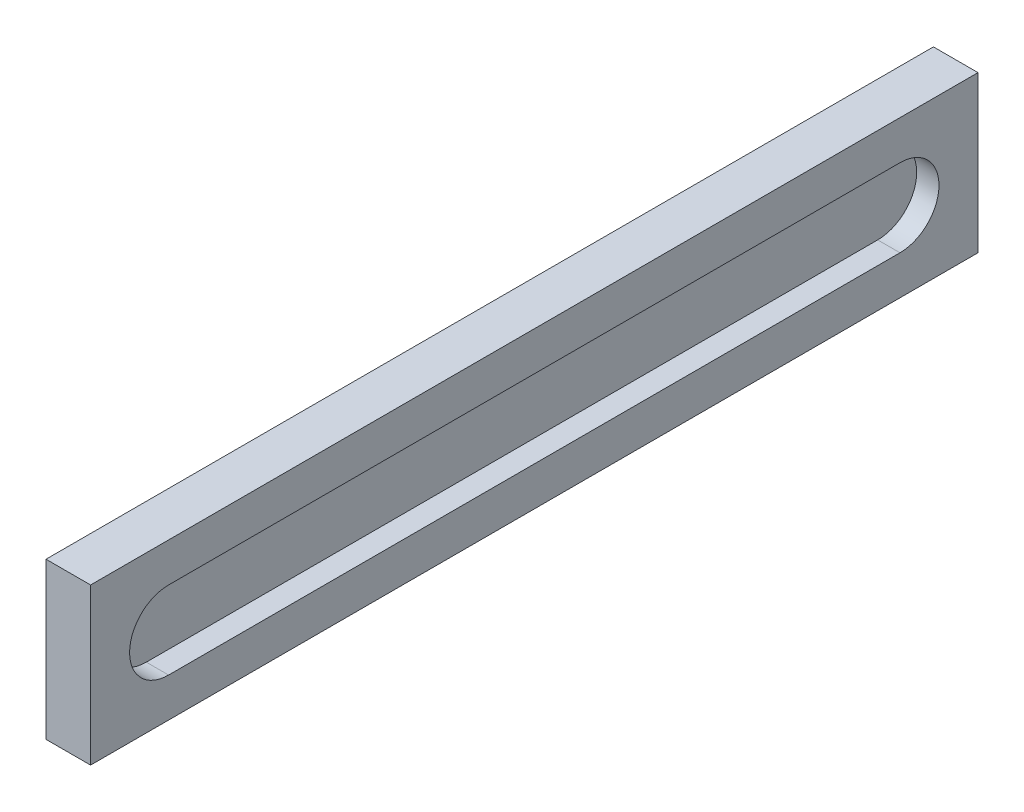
ISO-10303-21;
HEADER;
FILE_DESCRIPTION(('STEP AP214'),'2;1');
FILE_NAME('part.step','',(''),(''),'','','');
FILE_SCHEMA(('AUTOMOTIVE_DESIGN { 1 0 10303 214 1 1 1 1 }'));
ENDSEC;
DATA;
#1=APPLICATION_CONTEXT('core data for automotive mechanical design processes');
#2=APPLICATION_PROTOCOL_DEFINITION('international standard','automotive_design',2000,#1);
#3=PRODUCT_CONTEXT('',#1,'mechanical');
#4=PRODUCT('Part','Part','',(#3));
#5=PRODUCT_RELATED_PRODUCT_CATEGORY('part','',(#4));
#6=PRODUCT_DEFINITION_FORMATION('','',#4);
#7=PRODUCT_DEFINITION_CONTEXT('part definition',#1,'design');
#8=PRODUCT_DEFINITION('design','',#6,#7);
#9=PRODUCT_DEFINITION_SHAPE('','',#8);
#10=(LENGTH_UNIT() NAMED_UNIT(*) SI_UNIT(.MILLI.,.METRE.));
#11=(NAMED_UNIT(*) PLANE_ANGLE_UNIT() SI_UNIT($,.RADIAN.));
#12=(NAMED_UNIT(*) SI_UNIT($,.STERADIAN.) SOLID_ANGLE_UNIT());
#13=UNCERTAINTY_MEASURE_WITH_UNIT(LENGTH_MEASURE(1.E-05),#10,'distance_accuracy_value','');
#14=(GEOMETRIC_REPRESENTATION_CONTEXT(3) GLOBAL_UNCERTAINTY_ASSIGNED_CONTEXT((#13)) GLOBAL_UNIT_ASSIGNED_CONTEXT((#10,
#11,#12)) REPRESENTATION_CONTEXT('',''));
#15=CARTESIAN_POINT('',(0.,0.,0.));
#16=DIRECTION('',(0.,0.,1.));
#17=DIRECTION('',(1.,0.,0.));
#18=AXIS2_PLACEMENT_3D('',#15,#16,#17);
#19=CARTESIAN_POINT('',(20.,0.,0.));
#20=DIRECTION('',(0.,0.,-1.));
#21=DIRECTION('',(-1.,0.,0.));
#22=AXIS2_PLACEMENT_3D('',#19,#20,#21);
#23=PLANE('',#22);
#24=DIRECTION('',(0.,-1.,0.));
#25=VECTOR('',#24,1.);
#26=CARTESIAN_POINT('',(0.,0.,0.));
#27=LINE('',#26,#25);
#28=CARTESIAN_POINT('',(0.,70.,0.));
#29=VERTEX_POINT('',#28);
#30=CARTESIAN_POINT('',(0.,0.,0.));
#31=VERTEX_POINT('',#30);
#32=EDGE_CURVE('E158',#29,#31,#27,.T.);
#33=ORIENTED_EDGE('',*,*,#32,.T.);
#34=DIRECTION('',(-1.,0.,0.));
#35=VECTOR('',#34,1.);
#36=CARTESIAN_POINT('',(20.,0.,0.));
#37=LINE('',#36,#35);
#38=CARTESIAN_POINT('',(20.,0.,0.));
#39=VERTEX_POINT('',#38);
#40=EDGE_CURVE('E11',#39,#31,#37,.T.);
#41=ORIENTED_EDGE('',*,*,#40,.F.);
#42=DIRECTION('',(0.,-1.,0.));
#43=VECTOR('',#42,1.);
#44=CARTESIAN_POINT('',(20.,0.,0.));
#45=LINE('',#44,#43);
#46=CARTESIAN_POINT('',(20.,70.,0.));
#47=VERTEX_POINT('',#46);
#48=EDGE_CURVE('E164',#47,#39,#45,.T.);
#49=ORIENTED_EDGE('',*,*,#48,.F.);
#50=DIRECTION('',(-1.,0.,0.));
#51=VECTOR('',#50,1.);
#52=CARTESIAN_POINT('',(20.,70.,0.));
#53=LINE('',#52,#51);
#54=EDGE_CURVE('E174',#47,#29,#53,.T.);
#55=ORIENTED_EDGE('',*,*,#54,.T.);
#56=EDGE_LOOP('',(#33,#41,#49,#55));
#57=FACE_BOUND('',#56,.T.);
#58=ADVANCED_FACE('F39',(#57),#23,.F.);
#59=CARTESIAN_POINT('',(20.,0.,0.));
#60=DIRECTION('',(0.,1.,0.));
#61=DIRECTION('',(0.,0.,1.));
#62=AXIS2_PLACEMENT_3D('',#59,#60,#61);
#63=PLANE('',#62);
#64=DIRECTION('',(0.,0.,-1.));
#65=VECTOR('',#64,1.);
#66=CARTESIAN_POINT('',(0.,0.,0.));
#67=LINE('',#66,#65);
#68=CARTESIAN_POINT('',(0.,0.,-398.100558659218));
#69=VERTEX_POINT('',#68);
#70=EDGE_CURVE('E178',#31,#69,#67,.T.);
#71=ORIENTED_EDGE('',*,*,#70,.T.);
#72=DIRECTION('',(-1.,0.,0.));
#73=VECTOR('',#72,1.);
#74=CARTESIAN_POINT('',(20.,0.,-398.100558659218));
#75=LINE('',#74,#73);
#76=CARTESIAN_POINT('',(20.,0.,-398.100558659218));
#77=VERTEX_POINT('',#76);
#78=EDGE_CURVE('E47',#77,#69,#75,.T.);
#79=ORIENTED_EDGE('',*,*,#78,.F.);
#80=DIRECTION('',(0.,0.,-1.));
#81=VECTOR('',#80,1.);
#82=CARTESIAN_POINT('',(20.,0.,0.));
#83=LINE('',#82,#81);
#84=EDGE_CURVE('E91',#39,#77,#83,.T.);
#85=ORIENTED_EDGE('',*,*,#84,.F.);
#86=ORIENTED_EDGE('',*,*,#40,.T.);
#87=EDGE_LOOP('',(#71,#79,#85,#86));
#88=FACE_BOUND('',#87,.T.);
#89=ADVANCED_FACE('F213',(#88),#63,.F.);
#90=CARTESIAN_POINT('',(20.,0.,-398.100558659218));
#91=DIRECTION('',(0.,0.,1.));
#92=DIRECTION('',(1.,0.,0.));
#93=AXIS2_PLACEMENT_3D('',#90,#91,#92);
#94=PLANE('',#93);
#95=DIRECTION('',(0.,1.,0.));
#96=VECTOR('',#95,1.);
#97=CARTESIAN_POINT('',(0.,0.,-398.100558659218));
#98=LINE('',#97,#96);
#99=CARTESIAN_POINT('',(0.,70.,-398.100558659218));
#100=VERTEX_POINT('',#99);
#101=EDGE_CURVE('E181',#69,#100,#98,.T.);
#102=ORIENTED_EDGE('',*,*,#101,.T.);
#103=DIRECTION('',(-1.,0.,0.));
#104=VECTOR('',#103,1.);
#105=CARTESIAN_POINT('',(20.,70.,-398.100558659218));
#106=LINE('',#105,#104);
#107=CARTESIAN_POINT('',(20.,70.,-398.100558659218));
#108=VERTEX_POINT('',#107);
#109=EDGE_CURVE('E188',#108,#100,#106,.T.);
#110=ORIENTED_EDGE('',*,*,#109,.F.);
#111=DIRECTION('',(0.,1.,0.));
#112=VECTOR('',#111,1.);
#113=CARTESIAN_POINT('',(20.,0.,-398.100558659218));
#114=LINE('',#113,#112);
#115=EDGE_CURVE('E169',#77,#108,#114,.T.);
#116=ORIENTED_EDGE('',*,*,#115,.F.);
#117=ORIENTED_EDGE('',*,*,#78,.T.);
#118=EDGE_LOOP('',(#102,#110,#116,#117));
#119=FACE_BOUND('',#118,.T.);
#120=ADVANCED_FACE('F195',(#119),#94,.F.);
#121=CARTESIAN_POINT('',(20.,70.,0.));
#122=DIRECTION('',(0.,-1.,0.));
#123=DIRECTION('',(0.,0.,-1.));
#124=AXIS2_PLACEMENT_3D('',#121,#122,#123);
#125=PLANE('',#124);
#126=DIRECTION('',(0.,0.,1.));
#127=VECTOR('',#126,1.);
#128=CARTESIAN_POINT('',(0.,70.,0.));
#129=LINE('',#128,#127);
#130=EDGE_CURVE('E84',#100,#29,#129,.T.);
#131=ORIENTED_EDGE('',*,*,#130,.T.);
#132=ORIENTED_EDGE('',*,*,#54,.F.);
#133=DIRECTION('',(0.,0.,1.));
#134=VECTOR('',#133,1.);
#135=CARTESIAN_POINT('',(20.,70.,0.));
#136=LINE('',#135,#134);
#137=EDGE_CURVE('E63',#108,#47,#136,.T.);
#138=ORIENTED_EDGE('',*,*,#137,.F.);
#139=ORIENTED_EDGE('',*,*,#109,.T.);
#140=EDGE_LOOP('',(#131,#132,#138,#139));
#141=FACE_BOUND('',#140,.T.);
#142=ADVANCED_FACE('F203',(#141),#125,.F.);
#143=CARTESIAN_POINT('',(20.,0.,0.));
#144=DIRECTION('',(-1.,0.,0.));
#145=DIRECTION('',(0.,0.,1.));
#146=AXIS2_PLACEMENT_3D('',#143,#144,#145);
#147=PLANE('',#146);
#148=DIRECTION('',(0.,0.,-1.));
#149=VECTOR('',#148,1.);
#150=CARTESIAN_POINT('',(20.,17.5,-35.));
#151=LINE('',#150,#149);
#152=CARTESIAN_POINT('',(20.,17.5,-35.));
#153=VERTEX_POINT('',#152);
#154=CARTESIAN_POINT('',(20.,17.5,-363.100558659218));
#155=VERTEX_POINT('',#154);
#156=EDGE_CURVE('E149',#153,#155,#151,.T.);
#157=ORIENTED_EDGE('',*,*,#156,.F.);
#158=CARTESIAN_POINT('',(20.,35.,-35.));
#159=DIRECTION('',(1.,0.,0.));
#160=DIRECTION('',(0.,0.,-1.));
#161=AXIS2_PLACEMENT_3D('',#158,#159,#160);
#162=CIRCLE('',#161,17.5);
#163=CARTESIAN_POINT('',(20.,52.5,-35.));
#164=VERTEX_POINT('',#163);
#165=EDGE_CURVE('E54',#164,#153,#162,.T.);
#166=ORIENTED_EDGE('',*,*,#165,.F.);
#167=DIRECTION('',(0.,0.,1.));
#168=VECTOR('',#167,1.);
#169=CARTESIAN_POINT('',(20.,52.5,-35.));
#170=LINE('',#169,#168);
#171=CARTESIAN_POINT('',(20.,52.5,-363.100558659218));
#172=VERTEX_POINT('',#171);
#173=EDGE_CURVE('E136',#172,#164,#170,.T.);
#174=ORIENTED_EDGE('',*,*,#173,.F.);
#175=CARTESIAN_POINT('',(20.,35.,-363.100558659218));
#176=DIRECTION('',(1.,0.,0.));
#177=DIRECTION('',(0.,0.,1.));
#178=AXIS2_PLACEMENT_3D('',#175,#176,#177);
#179=CIRCLE('',#178,17.5);
#180=EDGE_CURVE('E140',#155,#172,#179,.T.);
#181=ORIENTED_EDGE('',*,*,#180,.F.);
#182=EDGE_LOOP('',(#157,#166,#174,#181));
#183=FACE_BOUND('',#182,.T.);
#184=ORIENTED_EDGE('',*,*,#48,.T.);
#185=ORIENTED_EDGE('',*,*,#84,.T.);
#186=ORIENTED_EDGE('',*,*,#115,.T.);
#187=ORIENTED_EDGE('',*,*,#137,.T.);
#188=EDGE_LOOP('',(#184,#185,#186,#187));
#189=FACE_BOUND('',#188,.T.);
#190=ADVANCED_FACE('F205',(#183,#189),#147,.F.);
#191=CARTESIAN_POINT('',(0.,0.,0.));
#192=DIRECTION('',(-1.,0.,0.));
#193=DIRECTION('',(0.,0.,1.));
#194=AXIS2_PLACEMENT_3D('',#191,#192,#193);
#195=PLANE('',#194);
#196=ORIENTED_EDGE('',*,*,#32,.F.);
#197=ORIENTED_EDGE('',*,*,#130,.F.);
#198=ORIENTED_EDGE('',*,*,#101,.F.);
#199=ORIENTED_EDGE('',*,*,#70,.F.);
#200=EDGE_LOOP('',(#196,#197,#198,#199));
#201=FACE_BOUND('',#200,.T.);
#202=ADVANCED_FACE('F199',(#201),#195,.T.);
#203=CARTESIAN_POINT('',(10.,35.,-35.));
#204=DIRECTION('',(1.,0.,0.));
#205=DIRECTION('',(0.,0.,-1.));
#206=AXIS2_PLACEMENT_3D('',#203,#204,#205);
#207=CYLINDRICAL_SURFACE('',#206,17.5);
#208=ORIENTED_EDGE('',*,*,#165,.T.);
#209=DIRECTION('',(1.,0.,0.));
#210=VECTOR('',#209,1.);
#211=CARTESIAN_POINT('',(10.,17.5,-35.));
#212=LINE('',#211,#210);
#213=CARTESIAN_POINT('',(10.,17.5,-35.));
#214=VERTEX_POINT('',#213);
#215=EDGE_CURVE('E111',#214,#153,#212,.T.);
#216=ORIENTED_EDGE('',*,*,#215,.F.);
#217=CARTESIAN_POINT('',(10.,35.,-35.));
#218=DIRECTION('',(1.,0.,0.));
#219=DIRECTION('',(0.,0.,-1.));
#220=AXIS2_PLACEMENT_3D('',#217,#218,#219);
#221=CIRCLE('',#220,17.5);
#222=CARTESIAN_POINT('',(10.,52.5,-35.));
#223=VERTEX_POINT('',#222);
#224=EDGE_CURVE('E115',#223,#214,#221,.T.);
#225=ORIENTED_EDGE('',*,*,#224,.F.);
#226=DIRECTION('',(1.,0.,0.));
#227=VECTOR('',#226,1.);
#228=CARTESIAN_POINT('',(10.,52.5,-35.));
#229=LINE('',#228,#227);
#230=EDGE_CURVE('E155',#223,#164,#229,.T.);
#231=ORIENTED_EDGE('',*,*,#230,.T.);
#232=EDGE_LOOP('',(#208,#216,#225,#231));
#233=FACE_BOUND('',#232,.T.);
#234=ADVANCED_FACE('F113',(#233),#207,.F.);
#235=CARTESIAN_POINT('',(10.,52.5,-35.));
#236=DIRECTION('',(0.,1.,0.));
#237=DIRECTION('',(0.,0.,1.));
#238=AXIS2_PLACEMENT_3D('',#235,#236,#237);
#239=PLANE('',#238);
#240=ORIENTED_EDGE('',*,*,#173,.T.);
#241=ORIENTED_EDGE('',*,*,#230,.F.);
#242=DIRECTION('',(0.,0.,1.));
#243=VECTOR('',#242,1.);
#244=CARTESIAN_POINT('',(10.,52.5,-35.));
#245=LINE('',#244,#243);
#246=CARTESIAN_POINT('',(10.,52.5,-363.100558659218));
#247=VERTEX_POINT('',#246);
#248=EDGE_CURVE('E122',#247,#223,#245,.T.);
#249=ORIENTED_EDGE('',*,*,#248,.F.);
#250=DIRECTION('',(1.,0.,0.));
#251=VECTOR('',#250,1.);
#252=CARTESIAN_POINT('',(10.,52.5,-363.100558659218));
#253=LINE('',#252,#251);
#254=EDGE_CURVE('E159',#247,#172,#253,.T.);
#255=ORIENTED_EDGE('',*,*,#254,.T.);
#256=EDGE_LOOP('',(#240,#241,#249,#255));
#257=FACE_BOUND('',#256,.T.);
#258=ADVANCED_FACE('F252',(#257),#239,.F.);
#259=CARTESIAN_POINT('',(10.,35.,-363.100558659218));
#260=DIRECTION('',(1.,0.,0.));
#261=DIRECTION('',(0.,0.,-1.));
#262=AXIS2_PLACEMENT_3D('',#259,#260,#261);
#263=CYLINDRICAL_SURFACE('',#262,17.5);
#264=ORIENTED_EDGE('',*,*,#180,.T.);
#265=ORIENTED_EDGE('',*,*,#254,.F.);
#266=CARTESIAN_POINT('',(10.,35.,-363.100558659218));
#267=DIRECTION('',(1.,0.,0.));
#268=DIRECTION('',(0.,0.,1.));
#269=AXIS2_PLACEMENT_3D('',#266,#267,#268);
#270=CIRCLE('',#269,17.5);
#271=CARTESIAN_POINT('',(10.,17.5,-363.100558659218));
#272=VERTEX_POINT('',#271);
#273=EDGE_CURVE('E131',#272,#247,#270,.T.);
#274=ORIENTED_EDGE('',*,*,#273,.F.);
#275=DIRECTION('',(1.,0.,0.));
#276=VECTOR('',#275,1.);
#277=CARTESIAN_POINT('',(10.,17.5,-363.100558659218));
#278=LINE('',#277,#276);
#279=EDGE_CURVE('E121',#272,#155,#278,.T.);
#280=ORIENTED_EDGE('',*,*,#279,.T.);
#281=EDGE_LOOP('',(#264,#265,#274,#280));
#282=FACE_BOUND('',#281,.T.);
#283=ADVANCED_FACE('F261',(#282),#263,.F.);
#284=CARTESIAN_POINT('',(10.,17.5,-35.));
#285=DIRECTION('',(0.,-1.,0.));
#286=DIRECTION('',(0.,0.,-1.));
#287=AXIS2_PLACEMENT_3D('',#284,#285,#286);
#288=PLANE('',#287);
#289=ORIENTED_EDGE('',*,*,#156,.T.);
#290=ORIENTED_EDGE('',*,*,#279,.F.);
#291=DIRECTION('',(0.,0.,-1.));
#292=VECTOR('',#291,1.);
#293=CARTESIAN_POINT('',(10.,17.5,-35.));
#294=LINE('',#293,#292);
#295=EDGE_CURVE('E125',#214,#272,#294,.T.);
#296=ORIENTED_EDGE('',*,*,#295,.F.);
#297=ORIENTED_EDGE('',*,*,#215,.T.);
#298=EDGE_LOOP('',(#289,#290,#296,#297));
#299=FACE_BOUND('',#298,.T.);
#300=ADVANCED_FACE('F126',(#299),#288,.F.);
#301=CARTESIAN_POINT('',(10.,35.,-35.));
#302=DIRECTION('',(1.,0.,0.));
#303=DIRECTION('',(0.,0.,-1.));
#304=AXIS2_PLACEMENT_3D('',#301,#302,#303);
#305=PLANE('',#304);
#306=ORIENTED_EDGE('',*,*,#224,.T.);
#307=ORIENTED_EDGE('',*,*,#295,.T.);
#308=ORIENTED_EDGE('',*,*,#273,.T.);
#309=ORIENTED_EDGE('',*,*,#248,.T.);
#310=EDGE_LOOP('',(#306,#307,#308,#309));
#311=FACE_BOUND('',#310,.T.);
#312=ADVANCED_FACE('F133',(#311),#305,.T.);
#313=CLOSED_SHELL('',(#58,#89,#120,#142,#190,#202,#234,#258,#283,#300,#312));
#314=MANIFOLD_SOLID_BREP('B2',#313);
#315=ADVANCED_BREP_SHAPE_REPRESENTATION('',(#18,#314),#14);
#316=SHAPE_DEFINITION_REPRESENTATION(#9,#315);
ENDSEC;
END-ISO-10303-21;
